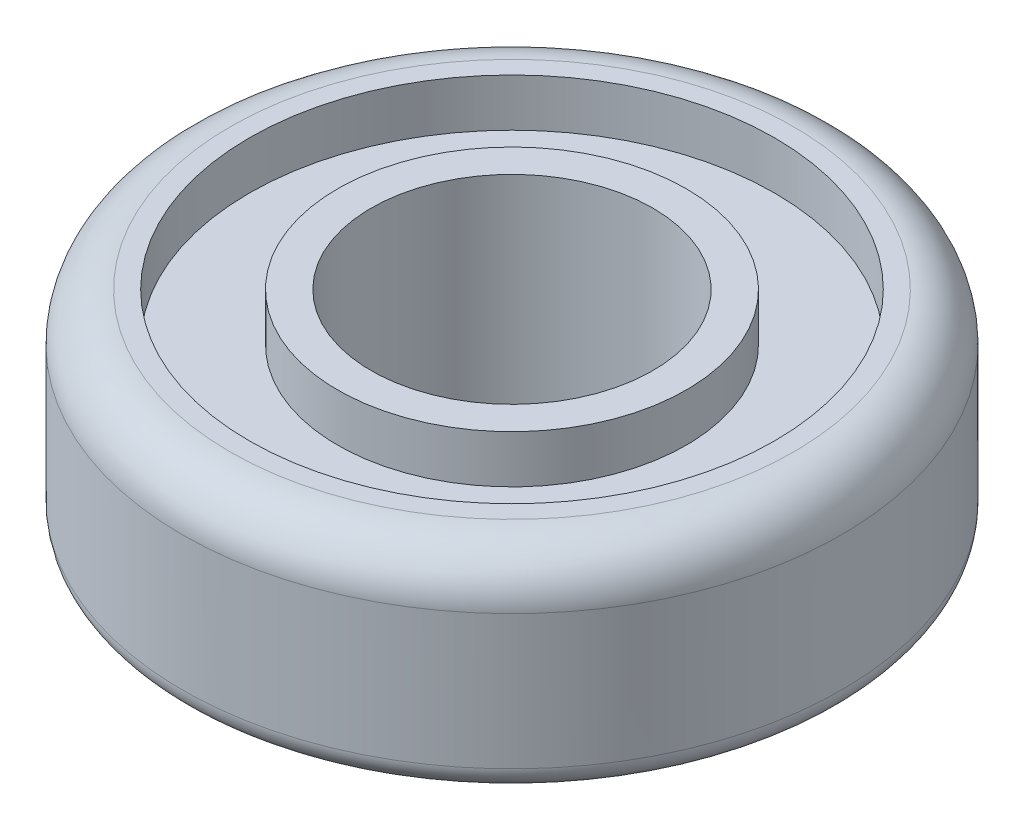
from build123d import *

# Parameters (mm, degrees)
FILLET1_R = 2.54
FILLET2_R = 1.27


with BuildPart() as part:
    # Sketch1 → Base-Revolve (revolve)
    with BuildSketch(Plane.XY, mode=Mode.PRIVATE) as base_revolve_sk:
        Polygon((7.4803, 5.4737), (7.4803, -5.4737), (9.2583, -5.4737), (9.2583, -2.9337), (13.9446, -2.9337), (13.9446, -5.4737), (17.5006, -5.4737), (17.5006, 5.4737), (13.9446, 5.4737), (13.9446, 2.9337), (9.2583, 2.9337), (9.2583, 5.4737), align=None)
    revolve(base_revolve_sk.sketch.rotate(Axis((0, 0, 0), (0, 1, 0)), 90), axis=Axis((0, 0, 0), (0, 1, 0)))

    # Fillet1
    fillet1_edges = [part.edges().sort_by_distance(p)[0] for p in [
        (0, 5.4737, 17.5006),
    ]]
    fillet(fillet1_edges, radius=FILLET1_R)

    # Fillet2
    fillet2_edges = [part.edges().sort_by_distance(p)[0] for p in [
        (0, -5.4737, 17.5006),
    ]]
    fillet(fillet2_edges, radius=FILLET2_R)


solid = part.part
